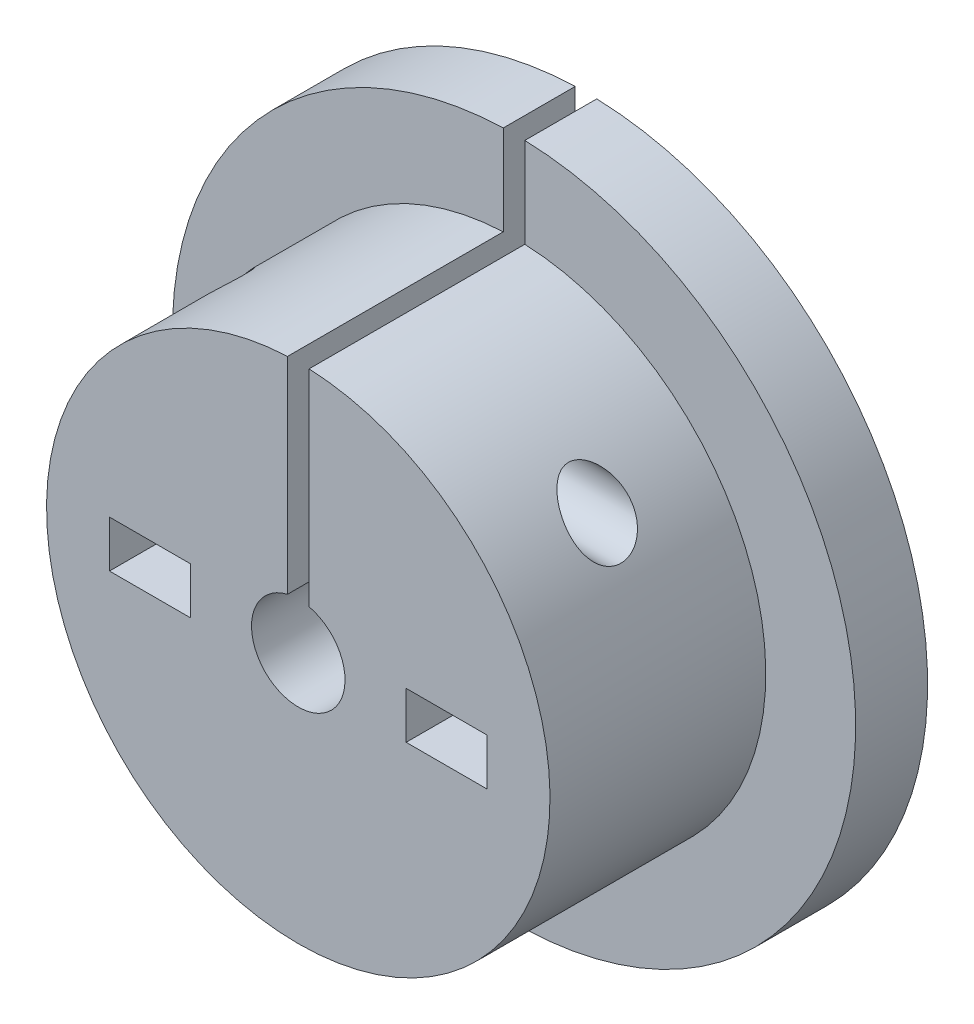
ISO-10303-21;
HEADER;
FILE_DESCRIPTION(('STEP AP214'),'2;1');
FILE_NAME('part.step','',(''),(''),'','','');
FILE_SCHEMA(('AUTOMOTIVE_DESIGN { 1 0 10303 214 1 1 1 1 }'));
ENDSEC;
DATA;
#1=APPLICATION_CONTEXT('core data for automotive mechanical design processes');
#2=APPLICATION_PROTOCOL_DEFINITION('international standard','automotive_design',2000,#1);
#3=PRODUCT_CONTEXT('',#1,'mechanical');
#4=PRODUCT('Part','Part','',(#3));
#5=PRODUCT_RELATED_PRODUCT_CATEGORY('part','',(#4));
#6=PRODUCT_DEFINITION_FORMATION('','',#4);
#7=PRODUCT_DEFINITION_CONTEXT('part definition',#1,'design');
#8=PRODUCT_DEFINITION('design','',#6,#7);
#9=PRODUCT_DEFINITION_SHAPE('','',#8);
#10=(LENGTH_UNIT() NAMED_UNIT(*) SI_UNIT(.MILLI.,.METRE.));
#11=(NAMED_UNIT(*) PLANE_ANGLE_UNIT() SI_UNIT($,.RADIAN.));
#12=(NAMED_UNIT(*) SI_UNIT($,.STERADIAN.) SOLID_ANGLE_UNIT());
#13=UNCERTAINTY_MEASURE_WITH_UNIT(LENGTH_MEASURE(1.E-05),#10,'distance_accuracy_value','');
#14=(GEOMETRIC_REPRESENTATION_CONTEXT(3) GLOBAL_UNCERTAINTY_ASSIGNED_CONTEXT((#13)) GLOBAL_UNIT_ASSIGNED_CONTEXT((#10,
#11,#12)) REPRESENTATION_CONTEXT('',''));
#15=CARTESIAN_POINT('',(0.,0.,0.));
#16=DIRECTION('',(0.,0.,1.));
#17=DIRECTION('',(1.,0.,0.));
#18=AXIS2_PLACEMENT_3D('',#15,#16,#17);
#19=CARTESIAN_POINT('',(0.,0.,4.));
#20=DIRECTION('',(0.,0.,-1.));
#21=DIRECTION('',(-1.,0.,0.));
#22=AXIS2_PLACEMENT_3D('',#19,#20,#21);
#23=CYLINDRICAL_SURFACE('',#22,19.);
#24=CARTESIAN_POINT('',(0.,0.,4.));
#25=DIRECTION('',(0.,0.,1.));
#26=DIRECTION('',(1.,0.,0.));
#27=AXIS2_PLACEMENT_3D('',#24,#25,#26);
#28=CIRCLE('',#27,19.);
#29=CARTESIAN_POINT('',(-0.6,18.9905239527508,4.));
#30=VERTEX_POINT('',#29);
#31=CARTESIAN_POINT('',(0.6,18.9905239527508,4.));
#32=VERTEX_POINT('',#31);
#33=EDGE_CURVE('E267',#30,#32,#28,.T.);
#34=ORIENTED_EDGE('',*,*,#33,.F.);
#35=DIRECTION('',(0.,0.,-1.));
#36=VECTOR('',#35,1.);
#37=CARTESIAN_POINT('',(-0.6,18.9905239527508,4.));
#38=LINE('',#37,#36);
#39=CARTESIAN_POINT('',(-0.6,18.9905239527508,0.));
#40=VERTEX_POINT('',#39);
#41=EDGE_CURVE('E271',#30,#40,#38,.T.);
#42=ORIENTED_EDGE('',*,*,#41,.T.);
#43=CARTESIAN_POINT('',(0.,0.,0.));
#44=DIRECTION('',(0.,0.,1.));
#45=DIRECTION('',(1.,0.,0.));
#46=AXIS2_PLACEMENT_3D('',#43,#44,#45);
#47=CIRCLE('',#46,19.);
#48=CARTESIAN_POINT('',(0.6,18.9905239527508,0.));
#49=VERTEX_POINT('',#48);
#50=EDGE_CURVE('E277',#40,#49,#47,.T.);
#51=ORIENTED_EDGE('',*,*,#50,.T.);
#52=DIRECTION('',(0.,0.,-1.));
#53=VECTOR('',#52,1.);
#54=CARTESIAN_POINT('',(0.6,18.9905239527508,4.));
#55=LINE('',#54,#53);
#56=EDGE_CURVE('E272',#49,#32,#55,.F.);
#57=ORIENTED_EDGE('',*,*,#56,.T.);
#58=EDGE_LOOP('',(#34,#42,#51,#57));
#59=FACE_BOUND('',#58,.T.);
#60=ADVANCED_FACE('F39',(#59),#23,.T.);
#61=CARTESIAN_POINT('',(0.,0.,4.));
#62=DIRECTION('',(0.,0.,1.));
#63=DIRECTION('',(1.,0.,0.));
#64=AXIS2_PLACEMENT_3D('',#61,#62,#63);
#65=PLANE('',#64);
#66=DIRECTION('',(0.,-1.,0.));
#67=VECTOR('',#66,1.);
#68=CARTESIAN_POINT('',(-0.6,0.,4.));
#69=LINE('',#68,#67);
#70=CARTESIAN_POINT('',(-0.6,13.9871369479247,4.));
#71=VERTEX_POINT('',#70);
#72=EDGE_CURVE('E166',#30,#71,#69,.T.);
#73=ORIENTED_EDGE('',*,*,#72,.F.);
#74=ORIENTED_EDGE('',*,*,#33,.T.);
#75=DIRECTION('',(0.,1.,0.));
#76=VECTOR('',#75,1.);
#77=CARTESIAN_POINT('',(0.6,0.,4.));
#78=LINE('',#77,#76);
#79=CARTESIAN_POINT('',(0.6,13.9871369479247,4.));
#80=VERTEX_POINT('',#79);
#81=EDGE_CURVE('E310',#80,#32,#78,.T.);
#82=ORIENTED_EDGE('',*,*,#81,.F.);
#83=CARTESIAN_POINT('',(0.,0.,4.));
#84=DIRECTION('',(0.,0.,1.));
#85=DIRECTION('',(1.,0.,0.));
#86=AXIS2_PLACEMENT_3D('',#83,#84,#85);
#87=CIRCLE('',#86,14.);
#88=EDGE_CURVE('E276',#80,#71,#87,.F.);
#89=ORIENTED_EDGE('',*,*,#88,.T.);
#90=EDGE_LOOP('',(#73,#74,#82,#89));
#91=FACE_BOUND('',#90,.T.);
#92=ADVANCED_FACE('F196',(#91),#65,.T.);
#93=CARTESIAN_POINT('',(0.,0.,0.));
#94=DIRECTION('',(0.,0.,1.));
#95=DIRECTION('',(1.,0.,0.));
#96=AXIS2_PLACEMENT_3D('',#93,#94,#95);
#97=PLANE('',#96);
#98=DIRECTION('',(-1.,0.,0.));
#99=VECTOR('',#98,1.);
#100=CARTESIAN_POINT('',(0.,1.3,0.));
#101=LINE('',#100,#99);
#102=CARTESIAN_POINT('',(-6.,1.3,0.));
#103=VERTEX_POINT('',#102);
#104=CARTESIAN_POINT('',(-10.5,1.3,0.));
#105=VERTEX_POINT('',#104);
#106=EDGE_CURVE('E298',#103,#105,#101,.T.);
#107=ORIENTED_EDGE('',*,*,#106,.T.);
#108=DIRECTION('',(0.,-1.,0.));
#109=VECTOR('',#108,1.);
#110=CARTESIAN_POINT('',(-10.5,0.,0.));
#111=LINE('',#110,#109);
#112=CARTESIAN_POINT('',(-10.5,-1.3,0.));
#113=VERTEX_POINT('',#112);
#114=EDGE_CURVE('E152',#105,#113,#111,.T.);
#115=ORIENTED_EDGE('',*,*,#114,.T.);
#116=DIRECTION('',(1.,0.,0.));
#117=VECTOR('',#116,1.);
#118=CARTESIAN_POINT('',(0.,-1.3,0.));
#119=LINE('',#118,#117);
#120=CARTESIAN_POINT('',(-6.,-1.3,0.));
#121=VERTEX_POINT('',#120);
#122=EDGE_CURVE('E329',#113,#121,#119,.T.);
#123=ORIENTED_EDGE('',*,*,#122,.T.);
#124=DIRECTION('',(0.,1.,0.));
#125=VECTOR('',#124,1.);
#126=CARTESIAN_POINT('',(-6.,0.,0.));
#127=LINE('',#126,#125);
#128=EDGE_CURVE('E327',#121,#103,#127,.T.);
#129=ORIENTED_EDGE('',*,*,#128,.T.);
#130=EDGE_LOOP('',(#107,#115,#123,#129));
#131=FACE_BOUND('',#130,.T.);
#132=DIRECTION('',(-1.,0.,0.));
#133=VECTOR('',#132,1.);
#134=CARTESIAN_POINT('',(0.,1.3,0.));
#135=LINE('',#134,#133);
#136=CARTESIAN_POINT('',(10.5,1.3,0.));
#137=VERTEX_POINT('',#136);
#138=CARTESIAN_POINT('',(6.,1.3,0.));
#139=VERTEX_POINT('',#138);
#140=EDGE_CURVE('E303',#137,#139,#135,.T.);
#141=ORIENTED_EDGE('',*,*,#140,.T.);
#142=DIRECTION('',(0.,-1.,0.));
#143=VECTOR('',#142,1.);
#144=CARTESIAN_POINT('',(6.,0.,0.));
#145=LINE('',#144,#143);
#146=CARTESIAN_POINT('',(6.,-1.3,0.));
#147=VERTEX_POINT('',#146);
#148=EDGE_CURVE('E334',#139,#147,#145,.T.);
#149=ORIENTED_EDGE('',*,*,#148,.T.);
#150=DIRECTION('',(1.,0.,0.));
#151=VECTOR('',#150,1.);
#152=CARTESIAN_POINT('',(0.,-1.3,0.));
#153=LINE('',#152,#151);
#154=CARTESIAN_POINT('',(10.5,-1.3,0.));
#155=VERTEX_POINT('',#154);
#156=EDGE_CURVE('E94',#147,#155,#153,.T.);
#157=ORIENTED_EDGE('',*,*,#156,.T.);
#158=DIRECTION('',(0.,1.,0.));
#159=VECTOR('',#158,1.);
#160=CARTESIAN_POINT('',(10.5,0.,0.));
#161=LINE('',#160,#159);
#162=EDGE_CURVE('E336',#155,#137,#161,.T.);
#163=ORIENTED_EDGE('',*,*,#162,.T.);
#164=EDGE_LOOP('',(#141,#149,#157,#163));
#165=FACE_BOUND('',#164,.T.);
#166=ORIENTED_EDGE('',*,*,#50,.F.);
#167=DIRECTION('',(0.,-1.,0.));
#168=VECTOR('',#167,1.);
#169=CARTESIAN_POINT('',(-0.6,0.,0.));
#170=LINE('',#169,#168);
#171=CARTESIAN_POINT('',(-0.600000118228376,2.52993670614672,-8.99999999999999E-06));
#172=VERTEX_POINT('',#171);
#173=EDGE_CURVE('E308',#40,#172,#170,.T.);
#174=ORIENTED_EDGE('',*,*,#173,.T.);
#175=CARTESIAN_POINT('',(-0.60005169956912,2.53026829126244,0.));
#176=CARTESIAN_POINT('',(-0.643668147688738,2.51989298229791,0.));
#177=CARTESIAN_POINT('',(-0.68701076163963,2.50836147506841,0.));
#178=CARTESIAN_POINT('',(-0.773252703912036,2.48299902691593,0.));
#179=CARTESIAN_POINT('',(-0.816148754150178,2.46915693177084,0.));
#180=CARTESIAN_POINT('',(-0.881555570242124,2.4461799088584,0.));
#181=CARTESIAN_POINT('',(-0.904341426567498,2.43781932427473,0.));
#182=CARTESIAN_POINT('',(-0.949786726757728,2.42043838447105,0.));
#183=CARTESIAN_POINT('',(-0.972445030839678,2.41141504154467,0.));
#184=CARTESIAN_POINT('',(-1.01447809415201,2.39401325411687,0.));
#185=CARTESIAN_POINT('',(-1.03388457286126,2.38571131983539,0.));
#186=CARTESIAN_POINT('',(-1.07241652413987,2.36868196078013,0.));
#187=CARTESIAN_POINT('',(-1.09154281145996,2.35995637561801,0.));
#188=CARTESIAN_POINT('',(-1.15131120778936,2.33181861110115,0.));
#189=CARTESIAN_POINT('',(-1.19157119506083,2.31158584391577,0.));
#190=CARTESIAN_POINT('',(-1.27078515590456,2.26914364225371,0.));
#191=CARTESIAN_POINT('',(-1.30974446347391,2.24694414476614,0.));
#192=CARTESIAN_POINT('',(-1.38636211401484,2.20057343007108,0.));
#193=CARTESIAN_POINT('',(-1.42402298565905,2.17640639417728,0.));
#194=CARTESIAN_POINT('',(-1.49804614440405,2.12610649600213,0.));
#195=CARTESIAN_POINT('',(-1.53440751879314,2.09997229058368,0.));
#196=CARTESIAN_POINT('',(-1.60583473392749,2.04574417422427,0.));
#197=CARTESIAN_POINT('',(-1.64089567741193,2.01764381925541,0.));
#198=CARTESIAN_POINT('',(-1.70972877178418,1.959485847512,0.));
#199=CARTESIAN_POINT('',(-1.74349166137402,1.92941724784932,0.));
#200=CARTESIAN_POINT('',(-1.7869433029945,1.88868881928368,0.));
#201=CARTESIAN_POINT('',(-1.7973439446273,1.87878053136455,0.));
#202=CARTESIAN_POINT('',(-1.818016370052,1.85876831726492,0.));
#203=CARTESIAN_POINT('',(-1.82828767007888,1.84866389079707,0.));
#204=CARTESIAN_POINT('',(-1.86043961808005,1.81652362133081,0.));
#205=CARTESIAN_POINT('',(-1.88202377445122,1.79418948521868,0.));
#206=CARTESIAN_POINT('',(-1.92427413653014,1.74890081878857,0.));
#207=CARTESIAN_POINT('',(-1.94494474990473,1.72595039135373,0.));
#208=CARTESIAN_POINT('',(-1.99467203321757,1.66872443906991,0.));
#209=CARTESIAN_POINT('',(-2.02326699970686,1.63404549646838,0.));
#210=CARTESIAN_POINT('',(-2.07849633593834,1.56336269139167,0.));
#211=CARTESIAN_POINT('',(-2.10513740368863,1.52736405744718,0.));
#212=CARTESIAN_POINT('',(-2.15646502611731,1.4540449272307,0.));
#213=CARTESIAN_POINT('',(-2.18115324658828,1.4167255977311,0.));
#214=CARTESIAN_POINT('',(-2.22857992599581,1.34076997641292,0.));
#215=CARTESIAN_POINT('',(-2.25131458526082,1.3021313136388,0.));
#216=CARTESIAN_POINT('',(-2.29695458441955,1.21971993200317,0.));
#217=CARTESIAN_POINT('',(-2.31964062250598,1.1758256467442,0.));
#218=CARTESIAN_POINT('',(-2.36268488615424,1.08646171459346,0.));
#219=CARTESIAN_POINT('',(-2.38302221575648,1.04098201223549,0.));
#220=CARTESIAN_POINT('',(-2.41777719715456,0.957114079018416,0.));
#221=CARTESIAN_POINT('',(-2.43260550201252,0.918895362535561,0.));
#222=CARTESIAN_POINT('',(-2.46036499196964,0.842066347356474,0.));
#223=CARTESIAN_POINT('',(-2.47330834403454,0.803460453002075,0.));
#224=CARTESIAN_POINT('',(-2.49858082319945,0.721726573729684,0.));
#225=CARTESIAN_POINT('',(-2.51071382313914,0.678537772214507,0.));
#226=CARTESIAN_POINT('',(-2.53266441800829,0.591686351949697,0.));
#227=CARTESIAN_POINT('',(-2.54248751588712,0.548025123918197,0.));
#228=CARTESIAN_POINT('',(-2.55982476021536,0.46023075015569,0.));
#229=CARTESIAN_POINT('',(-2.56733809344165,0.416097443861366,0.));
#230=CARTESIAN_POINT('',(-2.58006227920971,0.327359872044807,0.));
#231=CARTESIAN_POINT('',(-2.58526589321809,0.282754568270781,0.));
#232=CARTESIAN_POINT('',(-2.59287513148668,0.198619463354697,0.));
#233=CARTESIAN_POINT('',(-2.59553871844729,0.1591127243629,0.));
#234=CARTESIAN_POINT('',(-2.59910441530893,0.079738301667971,0.));
#235=CARTESIAN_POINT('',(-2.59999381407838,0.0398700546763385,0.));
#236=CARTESIAN_POINT('',(-2.60000789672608,-0.0508966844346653,0.));
#237=CARTESIAN_POINT('',(-2.59857649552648,-0.101796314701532,0.));
#238=CARTESIAN_POINT('',(-2.59276866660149,-0.203031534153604,0.));
#239=CARTESIAN_POINT('',(-2.58841520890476,-0.253368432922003,0.));
#240=CARTESIAN_POINT('',(-2.57741133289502,-0.348015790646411,0.));
#241=CARTESIAN_POINT('',(-2.57107685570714,-0.392363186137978,0.));
#242=CARTESIAN_POINT('',(-2.55609026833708,-0.480610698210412,0.));
#243=CARTESIAN_POINT('',(-2.54744094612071,-0.524511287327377,0.));
#244=CARTESIAN_POINT('',(-2.52783149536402,-0.611864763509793,0.));
#245=CARTESIAN_POINT('',(-2.51686776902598,-0.655316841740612,0.));
#246=CARTESIAN_POINT('',(-2.49263513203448,-0.741776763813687,0.));
#247=CARTESIAN_POINT('',(-2.47935648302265,-0.784781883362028,0.));
#248=CARTESIAN_POINT('',(-2.45547308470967,-0.855604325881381,0.));
#249=CARTESIAN_POINT('',(-2.44548612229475,-0.883631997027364,0.));
#250=CARTESIAN_POINT('',(-2.42451803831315,-0.939497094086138,0.));
#251=CARTESIAN_POINT('',(-2.41353155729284,-0.967332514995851,0.));
#252=CARTESIAN_POINT('',(-2.39612989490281,-1.00936556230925,0.));
#253=CARTESIAN_POINT('',(-2.39004884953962,-1.0237024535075,0.));
#254=CARTESIAN_POINT('',(-2.37765560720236,-1.052223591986,0.));
#255=CARTESIAN_POINT('',(-2.3713441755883,-1.06640817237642,0.));
#256=CARTESIAN_POINT('',(-2.34620785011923,-1.12158685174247,0.));
#257=CARTESIAN_POINT('',(-2.32645471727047,-1.16216374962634,0.));
#258=CARTESIAN_POINT('',(-2.2849705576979,-1.24201062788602,0.));
#259=CARTESIAN_POINT('',(-2.26325088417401,-1.2812865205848,0.));
#260=CARTESIAN_POINT('',(-2.21783831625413,-1.35853685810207,0.));
#261=CARTESIAN_POINT('',(-2.19415099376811,-1.39651457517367,0.));
#262=CARTESIAN_POINT('',(-2.14480916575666,-1.47117058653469,0.));
#263=CARTESIAN_POINT('',(-2.11915463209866,-1.50784886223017,0.));
#264=CARTESIAN_POINT('',(-2.06588445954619,-1.57990906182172,0.));
#265=CARTESIAN_POINT('',(-2.03826357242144,-1.6152871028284,0.));
#266=CARTESIAN_POINT('',(-1.98106371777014,-1.68475299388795,0.));
#267=CARTESIAN_POINT('',(-1.95147481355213,-1.71883267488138,0.));
#268=CARTESIAN_POINT('',(-1.90762873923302,-1.76679754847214,0.));
#269=CARTESIAN_POINT('',(-1.89405563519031,-1.7813135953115,0.));
#270=CARTESIAN_POINT('',(-1.86653393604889,-1.810098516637,0.));
#271=CARTESIAN_POINT('',(-1.85258404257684,-1.82436615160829,0.));
#272=CARTESIAN_POINT('',(-1.82042783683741,-1.85653391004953,0.));
#273=CARTESIAN_POINT('',(-1.80212178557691,-1.87433452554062,0.));
#274=CARTESIAN_POINT('',(-1.76509115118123,-1.90931657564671,0.));
#275=CARTESIAN_POINT('',(-1.74636894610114,-1.92650053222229,0.));
#276=CARTESIAN_POINT('',(-1.69381714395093,-1.97334340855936,0.));
#277=CARTESIAN_POINT('',(-1.65946008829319,-2.0024147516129,0.));
#278=CARTESIAN_POINT('',(-1.58942009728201,-2.05859552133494,0.));
#279=CARTESIAN_POINT('',(-1.55374344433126,-2.085712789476,0.));
#280=CARTESIAN_POINT('',(-1.48106768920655,-2.13799151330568,0.));
#281=CARTESIAN_POINT('',(-1.44407070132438,-2.16315590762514,0.));
#282=CARTESIAN_POINT('',(-1.36875678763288,-2.21153438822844,0.));
#283=CARTESIAN_POINT('',(-1.33043829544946,-2.23474603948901,0.));
#284=CARTESIAN_POINT('',(-1.26777402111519,-2.27050164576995,0.));
#285=CARTESIAN_POINT('',(-1.24378971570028,-2.28368363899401,0.));
#286=CARTESIAN_POINT('',(-1.19533263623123,-2.30932643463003,0.));
#287=CARTESIAN_POINT('',(-1.1708584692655,-2.3217846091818,0.));
#288=CARTESIAN_POINT('',(-1.12142248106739,-2.34597980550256,0.));
#289=CARTESIAN_POINT('',(-1.09645898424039,-2.35771340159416,0.));
#290=CARTESIAN_POINT('',(-1.04604525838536,-2.38046115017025,0.));
#291=CARTESIAN_POINT('',(-1.02059313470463,-2.39147109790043,0.));
#292=CARTESIAN_POINT('',(-0.962208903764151,-2.41566627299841,0.));
#293=CARTESIAN_POINT('',(-0.929172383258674,-2.42860062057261,0.));
#294=CARTESIAN_POINT('',(-0.862808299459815,-2.45305077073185,0.));
#295=CARTESIAN_POINT('',(-0.829483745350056,-2.46457475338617,0.));
#296=CARTESIAN_POINT('',(-0.753223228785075,-2.48921934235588,0.));
#297=CARTESIAN_POINT('',(-0.710149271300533,-2.50191571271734,0.));
#298=CARTESIAN_POINT('',(-0.623527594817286,-2.52499136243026,0.));
#299=CARTESIAN_POINT('',(-0.579981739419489,-2.53537764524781,0.));
#300=CARTESIAN_POINT('',(-0.492417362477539,-2.55383979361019,0.));
#301=CARTESIAN_POINT('',(-0.448398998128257,-2.56191640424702,0.));
#302=CARTESIAN_POINT('',(-0.359891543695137,-2.575765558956,0.));
#303=CARTESIAN_POINT('',(-0.315401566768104,-2.58153242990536,0.));
#304=CARTESIAN_POINT('',(-0.225995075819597,-2.59076348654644,0.));
#305=CARTESIAN_POINT('',(-0.181077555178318,-2.59421790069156,0.));
#306=CARTESIAN_POINT('',(-0.0907740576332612,-2.59884162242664,0.));
#307=CARTESIAN_POINT('',(-0.0453871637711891,-2.59999285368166,0.));
#308=CARTESIAN_POINT('',(0.0453936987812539,-2.60000714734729,0.));
#309=CARTESIAN_POINT('',(0.0907876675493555,-2.59886988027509,0.));
#310=CARTESIAN_POINT('',(0.18112798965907,-2.5942575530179,0.));
#311=CARTESIAN_POINT('',(0.226075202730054,-2.59079949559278,0.));
#312=CARTESIAN_POINT('',(0.31547787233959,-2.58155840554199,0.));
#313=CARTESIAN_POINT('',(0.35993467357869,-2.57578840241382,0.));
#314=CARTESIAN_POINT('',(0.448400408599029,-2.56192917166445,0.));
#315=CARTESIAN_POINT('',(0.492410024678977,-2.55384430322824,0.));
#316=CARTESIAN_POINT('',(0.579981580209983,-2.53536211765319,0.));
#317=CARTESIAN_POINT('',(0.623543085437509,-2.52496274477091,0.));
#318=CARTESIAN_POINT('',(0.710220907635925,-2.50185752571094,0.));
#319=CARTESIAN_POINT('',(0.753335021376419,-2.48914340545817,0.));
#320=CARTESIAN_POINT('',(0.829601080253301,-2.46449175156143,0.));
#321=CARTESIAN_POINT('',(0.862891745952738,-2.45298052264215,0.));
#322=CARTESIAN_POINT('',(0.929205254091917,-2.42856220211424,0.));
#323=CARTESIAN_POINT('',(0.962224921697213,-2.41564647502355,0.));
#324=CARTESIAN_POINT('',(1.02058911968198,-2.39148305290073,0.));
#325=CARTESIAN_POINT('',(1.04603762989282,-2.38048551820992,0.));
#326=CARTESIAN_POINT('',(1.09644978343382,-2.35775389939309,0.));
#327=CARTESIAN_POINT('',(1.12141522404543,-2.34602380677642,0.));
#328=CARTESIAN_POINT('',(1.17086154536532,-2.3218287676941,0.));
#329=CARTESIAN_POINT('',(1.19534398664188,-2.30936701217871,0.));
#330=CARTESIAN_POINT('',(1.24382387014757,-2.28370973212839,0.));
#331=CARTESIAN_POINT('',(1.26782257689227,-2.27051659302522,0.));
#332=CARTESIAN_POINT('',(1.33047851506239,-2.23475328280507,0.));
#333=CARTESIAN_POINT('',(1.36877417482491,-2.21154516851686,0.));
#334=CARTESIAN_POINT('',(1.44406384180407,-2.16316104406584,0.));
#335=CARTESIAN_POINT('',(1.48105869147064,-2.13798634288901,0.));
#336=CARTESIAN_POINT('',(1.55375163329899,-2.08567423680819,0.));
#337=CARTESIAN_POINT('',(1.58944683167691,-2.05853281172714,0.));
#338=CARTESIAN_POINT('',(1.65954556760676,-2.00229105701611,0.));
#339=CARTESIAN_POINT('',(1.69394201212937,-1.97318187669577,0.));
#340=CARTESIAN_POINT('',(1.74650010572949,-1.92633341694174,0.));
#341=CARTESIAN_POINT('',(1.76518979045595,-1.90918232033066,0.));
#342=CARTESIAN_POINT('',(1.80216557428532,-1.87426672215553,0.));
#343=CARTESIAN_POINT('',(1.82044918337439,-1.85649957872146,0.));
#344=CARTESIAN_POINT('',(1.85262399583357,-1.82433636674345,0.));
#345=CARTESIAN_POINT('',(1.86661325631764,-1.81003821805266,0.));
#346=CARTESIAN_POINT('',(1.89421252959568,-1.78118554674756,0.));
#347=CARTESIAN_POINT('',(1.90782378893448,-1.76663221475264,0.));
#348=CARTESIAN_POINT('',(1.95166676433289,-1.71867446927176,0.));
#349=CARTESIAN_POINT('',(1.98121447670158,-1.68463924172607,0.));
#350=CARTESIAN_POINT('',(2.03834660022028,-1.61524221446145,0.));
#351=CARTESIAN_POINT('',(2.06593995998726,-1.57988776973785,0.));
#352=CARTESIAN_POINT('',(2.11916999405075,-1.50785486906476,0.));
#353=CARTESIAN_POINT('',(2.14481085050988,-1.47117950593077,0.));
#354=CARTESIAN_POINT('',(2.19414027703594,-1.3965093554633,0.));
#355=CARTESIAN_POINT('',(2.21782775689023,-1.35851384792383,0.));
#356=CARTESIAN_POINT('',(2.26325559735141,-1.2812078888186,0.));
#357=CARTESIAN_POINT('',(2.2849892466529,-1.24189349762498,0.));
#358=CARTESIAN_POINT('',(2.32651650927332,-1.16194959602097,0.));
#359=CARTESIAN_POINT('',(2.34629764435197,-1.12131358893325,0.));
#360=CARTESIAN_POINT('',(2.37144033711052,-1.06613155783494,0.));
#361=CARTESIAN_POINT('',(2.3777295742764,-1.05200254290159,0.));
#362=CARTESIAN_POINT('',(2.39008312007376,-1.02359205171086,0.));
#363=CARTESIAN_POINT('',(2.39614663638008,-1.009310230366,0.));
#364=CARTESIAN_POINT('',(2.41355937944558,-0.967294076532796,0.));
#365=CARTESIAN_POINT('',(2.42457179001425,-0.939419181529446,0.));
#366=CARTESIAN_POINT('',(2.44558614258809,-0.883465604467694,0.));
#367=CARTESIAN_POINT('',(2.4555932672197,-0.855388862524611,0.));
#368=CARTESIAN_POINT('',(2.47948138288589,-0.784551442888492,0.));
#369=CARTESIAN_POINT('',(2.49274600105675,-0.741580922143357,0.));
#370=CARTESIAN_POINT('',(2.51695378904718,-0.655171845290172,0.));
#371=CARTESIAN_POINT('',(2.52790576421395,-0.611735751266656,0.));
#372=CARTESIAN_POINT('',(2.54749508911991,-0.524395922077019,0.));
#373=CARTESIAN_POINT('',(2.55613505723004,-0.480492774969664,0.));
#374=CARTESIAN_POINT('',(2.57110651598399,-0.392221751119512,0.));
#375=CARTESIAN_POINT('',(2.57743421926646,-0.347853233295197,0.));
#376=CARTESIAN_POINT('',(2.58841694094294,-0.253225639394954,0.));
#377=CARTESIAN_POINT('',(2.5927598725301,-0.202930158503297,0.));
#378=CARTESIAN_POINT('',(2.59856379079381,-0.101756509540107,0.));
#379=CARTESIAN_POINT('',(2.60000062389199,-0.0508769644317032,0.));
#380=CARTESIAN_POINT('',(2.59999951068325,0.0399026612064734,0.));
#381=CARTESIAN_POINT('',(2.59911480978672,0.079803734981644,0.));
#382=CARTESIAN_POINT('',(2.59554712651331,0.159256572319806,0.));
#383=CARTESIAN_POINT('',(2.59287632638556,0.198808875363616,0.));
#384=CARTESIAN_POINT('',(2.58525116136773,0.282959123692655,0.));
#385=CARTESIAN_POINT('',(2.58004198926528,0.327534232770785,0.));
#386=CARTESIAN_POINT('',(2.56730511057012,0.416230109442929,0.));
#387=CARTESIAN_POINT('',(2.55978364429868,0.460351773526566,0.));
#388=CARTESIAN_POINT('',(2.54242856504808,0.548141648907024,0.));
#389=CARTESIAN_POINT('',(2.53259477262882,0.591809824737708,0.));
#390=CARTESIAN_POINT('',(2.5106220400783,0.6786938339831,0.));
#391=CARTESIAN_POINT('',(2.49847663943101,0.721908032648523,0.));
#392=CARTESIAN_POINT('',(2.4718848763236,0.80788507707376,0.));
#393=CARTESIAN_POINT('',(2.45742610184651,0.850644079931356,0.));
#394=CARTESIAN_POINT('',(2.42623198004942,0.935686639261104,0.));
#395=CARTESIAN_POINT('',(2.40948036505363,0.977964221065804,0.));
#396=CARTESIAN_POINT('',(2.37392968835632,1.06144668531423,0.));
#397=CARTESIAN_POINT('',(2.35513924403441,1.10265523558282,0.));
#398=CARTESIAN_POINT('',(2.31557368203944,1.18376637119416,0.));
#399=CARTESIAN_POINT('',(2.29481277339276,1.22367587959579,0.));
#400=CARTESIAN_POINT('',(2.25131585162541,1.30219192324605,0.));
#401=CARTESIAN_POINT('',(2.2285882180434,1.34080309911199,0.));
#402=CARTESIAN_POINT('',(2.18116281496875,1.41672462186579,0.));
#403=CARTESIAN_POINT('',(2.1564677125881,1.45403663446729,0.));
#404=CARTESIAN_POINT('',(2.10511319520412,1.52736284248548,0.));
#405=CARTESIAN_POINT('',(2.07845101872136,1.5633751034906,0.));
#406=CARTESIAN_POINT('',(2.02316836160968,1.63410626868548,0.));
#407=CARTESIAN_POINT('',(1.99454016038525,1.66881913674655,0.));
#408=CARTESIAN_POINT('',(1.93532773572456,1.73695284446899,0.));
#409=CARTESIAN_POINT('',(1.90473142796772,1.77036317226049,0.));
#410=CARTESIAN_POINT('',(1.84176650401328,1.8357308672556,0.));
#411=CARTESIAN_POINT('',(1.80939121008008,1.86768179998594,0.));
#412=CARTESIAN_POINT('',(1.74329297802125,1.92964313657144,0.));
#413=CARTESIAN_POINT('',(1.70958212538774,1.95966642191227,0.));
#414=CARTESIAN_POINT('',(1.64082985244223,2.0177493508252,0.));
#415=CARTESIAN_POINT('',(1.60579689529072,2.04581900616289,0.));
#416=CARTESIAN_POINT('',(1.5344065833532,2.10000039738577,0.));
#417=CARTESIAN_POINT('',(1.49805332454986,2.12611752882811,0.));
#418=CARTESIAN_POINT('',(1.42402633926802,2.17639815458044,0.));
#419=CARTESIAN_POINT('',(1.38635277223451,2.2005618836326,0.));
#420=CARTESIAN_POINT('',(1.30968931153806,2.24694140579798,0.));
#421=CARTESIAN_POINT('',(1.2706962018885,2.26915188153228,0.));
#422=CARTESIAN_POINT('',(1.19139632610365,2.31162936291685,0.));
#423=CARTESIAN_POINT('',(1.15108362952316,2.3318852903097,0.));
#424=CARTESIAN_POINT('',(1.06915795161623,2.3704596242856,0.));
#425=CARTESIAN_POINT('',(1.02753727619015,2.38876167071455,0.));
#426=CARTESIAN_POINT('',(0.943546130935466,2.42319089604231,0.));
#427=CARTESIAN_POINT('',(0.90117817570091,2.4393242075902,0.));
#428=CARTESIAN_POINT('',(0.815961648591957,2.4692630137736,0.));
#429=CARTESIAN_POINT('',(0.773118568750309,2.48308411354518,0.));
#430=CARTESIAN_POINT('',(0.686958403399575,2.50841071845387,0.));
#431=CARTESIAN_POINT('',(0.643644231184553,2.51992614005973,0.));
#432=CARTESIAN_POINT('',(0.600053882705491,2.53028751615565,0.));
#433=B_SPLINE_CURVE_WITH_KNOTS('',3,(#175,#176,#177,#178,#179,#180,#181,#182,#183,#184,#185,
#186,#187,#188,#189,#190,#191,#192,#193,#194,#195,#196,#197,#198,#199,#200,#201,#202,#203,#204,
#205,#206,#207,#208,#209,#210,#211,#212,#213,#214,#215,#216,#217,#218,#219,#220,#221,#222,#223,
#224,#225,#226,#227,#228,#229,#230,#231,#232,#233,#234,#235,#236,#237,#238,#239,#240,#241,#242,
#243,#244,#245,#246,#247,#248,#249,#250,#251,#252,#253,#254,#255,#256,#257,#258,#259,#260,#261,
#262,#263,#264,#265,#266,#267,#268,#269,#270,#271,#272,#273,#274,#275,#276,#277,#278,#279,#280,
#281,#282,#283,#284,#285,#286,#287,#288,#289,#290,#291,#292,#293,#294,#295,#296,#297,#298,#299,
#300,#301,#302,#303,#304,#305,#306,#307,#308,#309,#310,#311,#312,#313,#314,#315,#316,#317,#318,
#319,#320,#321,#322,#323,#324,#325,#326,#327,#328,#329,#330,#331,#332,#333,#334,#335,#336,#337,
#338,#339,#340,#341,#342,#343,#344,#345,#346,#347,#348,#349,#350,#351,#352,#353,#354,#355,#356,
#357,#358,#359,#360,#361,#362,#363,#364,#365,#366,#367,#368,#369,#370,#371,#372,#373,#374,#375,
#376,#377,#378,#379,#380,#381,#382,#383,#384,#385,#386,#387,#388,#389,#390,#391,#392,#393,#394,
#395,#396,#397,#398,#399,#400,#401,#402,#403,#404,#405,#406,#407,#408,#409,#410,#411,#412,#413,
#414,#415,#416,#417,#418,#419,#420,#421,#422,#423,#424,#425,#426,#427,#428,#429,#430,#431,#432),
.UNSPECIFIED.,.F.,.F.,(4,2,2,2,2,2,2,2,2,2,2,2,2,2,2,2,2,2,2,2,2,2,2,2,2,2,2,2,2,2,2,2,2,2,2,2,
2,2,2,2,2,2,2,2,2,2,2,2,2,2,2,2,2,2,2,2,2,2,2,2,2,2,2,2,2,2,2,2,2,2,2,2,2,2,2,2,2,2,2,2,2,2,2,2,
2,2,2,2,2,2,2,2,2,2,2,2,2,2,2,2,2,2,2,2,2,2,2,2,2,2,2,2,2,2,2,2,2,2,2,2,2,2,2,2,2,2,2,2,4),(0.,
0.134488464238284,0.269646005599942,0.342452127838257,0.415609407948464,0.478926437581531,
0.54198957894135,0.677097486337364,0.811557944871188,0.945739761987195,1.08001404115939,
1.21475112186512,1.35031755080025,1.39341076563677,1.43663406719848,1.52979139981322,
1.62243474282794,1.75721325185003,1.89150575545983,2.02568244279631,2.16011445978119,
2.30826395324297,2.45764375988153,2.58058547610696,2.70269465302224,2.83721438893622,
2.9714103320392,3.10565346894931,3.24031439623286,3.35906344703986,3.47866026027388,
3.63133327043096,3.78281997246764,3.917151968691,4.05132289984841,4.18570395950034,
4.32066460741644,4.4099110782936,4.49966800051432,4.5463855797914,4.59296001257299,
4.72828120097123,4.86286569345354,4.99708128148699,5.13129878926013,5.2658890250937,
5.40121973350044,5.46083554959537,5.52069286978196,5.59728302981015,5.67351236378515,
5.80846514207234,5.94284213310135,6.07701283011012,6.21134842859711,6.29344047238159,
6.37581399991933,6.45855110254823,6.54173279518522,6.64813804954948,6.75389353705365,
6.88854825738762,7.02278900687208,7.15698640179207,7.29151141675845,7.42660135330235,
7.56274743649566,7.69891312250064,7.8340919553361,7.96851943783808,8.10269542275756,
8.2369910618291,8.37177651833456,8.47742382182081,8.58376196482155,8.66691881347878,
8.74965655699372,8.83205698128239,8.91420287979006,9.04847430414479,9.182657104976,
9.31712237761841,9.4522388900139,9.52832986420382,9.60480191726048,9.66480716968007,
9.72458277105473,9.85973152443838,9.99421498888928,10.128401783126,10.262662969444,
10.3973689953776,10.5328866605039,10.579281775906,10.6258267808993,10.715722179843,
10.8051273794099,10.9399762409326,11.074302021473,11.208475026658,11.3428668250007,
11.4942277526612,11.6468416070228,11.7665362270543,11.8854226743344,12.0199955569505,
12.1542084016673,12.2884316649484,12.4230357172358,12.5583878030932,12.6947554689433,
12.830567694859,12.9654658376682,13.0998151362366,13.2339853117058,13.3683475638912,
13.5032715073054,13.639122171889,13.7755231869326,13.9108895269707,14.0455013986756,
14.179726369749,14.3139351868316,14.4484987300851,14.5837849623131,14.7201273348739,
14.8560756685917,14.9910658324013,15.125462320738),.UNSPECIFIED.);
#434=CARTESIAN_POINT('',(0.600000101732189,2.52994164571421,-8.99999999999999E-06));
#435=VERTEX_POINT('',#434);
#436=EDGE_CURVE('E162',#172,#435,#433,.T.);
#437=ORIENTED_EDGE('',*,*,#436,.T.);
#438=DIRECTION('',(0.,1.,0.));
#439=VECTOR('',#438,1.);
#440=CARTESIAN_POINT('',(0.6,0.,0.));
#441=LINE('',#440,#439);
#442=EDGE_CURVE('E307',#435,#49,#441,.T.);
#443=ORIENTED_EDGE('',*,*,#442,.T.);
#444=EDGE_LOOP('',(#166,#174,#437,#443));
#445=FACE_BOUND('',#444,.T.);
#446=ADVANCED_FACE('F198',(#131,#165,#445),#97,.F.);
#447=CARTESIAN_POINT('',(0.,0.,16.));
#448=DIRECTION('',(0.,0.,-1.));
#449=DIRECTION('',(-1.,0.,0.));
#450=AXIS2_PLACEMENT_3D('',#447,#448,#449);
#451=CYLINDRICAL_SURFACE('',#450,14.);
#452=CARTESIAN_POINT('',(-10.7238052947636,9.,8.3));
#453=CARTESIAN_POINT('',(-10.6315978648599,9.10986405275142,8.29999997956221));
#454=CARTESIAN_POINT('',(-10.5376594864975,9.21834091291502,8.31063631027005));
#455=CARTESIAN_POINT('',(-10.3482239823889,9.43051622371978,8.35185194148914));
#456=CARTESIAN_POINT('',(-10.2527226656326,9.53419731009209,8.38249843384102));
#457=CARTESIAN_POINT('',(-10.0469131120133,9.75116642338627,8.46977943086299));
#458=CARTESIAN_POINT('',(-9.93673641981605,9.86325427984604,8.52984325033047));
#459=CARTESIAN_POINT('',(-9.77601608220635,10.0217380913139,8.63979091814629));
#460=CARTESIAN_POINT('',(-9.72322681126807,10.0729334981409,8.67972243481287));
#461=CARTESIAN_POINT('',(-9.61993029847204,10.1716280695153,8.76646798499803));
#462=CARTESIAN_POINT('',(-9.56942133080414,10.2191300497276,8.81327669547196));
#463=CARTESIAN_POINT('',(-9.4650273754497,10.3159580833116,8.9210190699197));
#464=CARTESIAN_POINT('',(-9.41162575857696,10.3646447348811,8.98300903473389));
#465=CARTESIAN_POINT('',(-9.31138533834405,10.4547898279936,9.11678339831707));
#466=CARTESIAN_POINT('',(-9.26453628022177,10.4962595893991,9.18855213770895));
#467=CARTESIAN_POINT('',(-9.18961035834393,10.5618649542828,9.32544242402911));
#468=CARTESIAN_POINT('',(-9.15966407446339,10.5878100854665,9.38865828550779));
#469=CARTESIAN_POINT('',(-9.1077377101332,10.6325111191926,9.52068531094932));
#470=CARTESIAN_POINT('',(-9.08574686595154,10.6512767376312,9.58948875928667));
#471=CARTESIAN_POINT('',(-9.05428835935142,10.6780254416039,9.72068246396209));
#472=CARTESIAN_POINT('',(-9.04344011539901,10.6872009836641,9.78249403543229));
#473=CARTESIAN_POINT('',(-9.02989499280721,10.6986485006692,9.90762973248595));
#474=CARTESIAN_POINT('',(-9.02719311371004,10.7009247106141,9.97095290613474));
#475=CARTESIAN_POINT('',(-9.03019589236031,10.6983907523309,10.0972701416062));
#476=CARTESIAN_POINT('',(-9.03590313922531,10.6935784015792,10.1602640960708));
#477=CARTESIAN_POINT('',(-9.05518746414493,10.6772531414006,10.2841396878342));
#478=CARTESIAN_POINT('',(-9.06877027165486,10.6657353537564,10.3450197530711));
#479=CARTESIAN_POINT('',(-9.10703492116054,10.6330940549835,10.4783648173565));
#480=CARTESIAN_POINT('',(-9.13365784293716,10.6102753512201,10.5498527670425));
#481=CARTESIAN_POINT('',(-9.19507828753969,10.5570917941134,10.6861834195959));
#482=CARTESIAN_POINT('',(-9.22989064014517,10.526713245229,10.7510137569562));
#483=CARTESIAN_POINT('',(-9.32128503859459,10.4459904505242,10.8994075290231));
#484=CARTESIAN_POINT('',(-9.38087910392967,10.3926122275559,10.9794490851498));
#485=CARTESIAN_POINT('',(-9.50743394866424,10.2769700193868,11.1260985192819));
#486=CARTESIAN_POINT('',(-9.57440941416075,10.2146882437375,11.1926788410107));
#487=CARTESIAN_POINT('',(-9.73986438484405,10.0574644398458,11.3368560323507));
#488=CARTESIAN_POINT('',(-9.8404094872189,9.95928410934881,11.4085555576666));
#489=CARTESIAN_POINT('',(-10.0449501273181,9.7529575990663,11.5288290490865));
#490=CARTESIAN_POINT('',(-10.1489487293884,9.64480240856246,11.5773818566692));
#491=CARTESIAN_POINT('',(-10.3588245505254,9.41907025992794,11.6518871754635));
#492=CARTESIAN_POINT('',(-10.4647042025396,9.30136635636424,11.6774496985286));
#493=CARTESIAN_POINT('',(-10.6736459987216,9.06082716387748,11.703203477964));
#494=CARTESIAN_POINT('',(-10.776710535,8.93799647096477,11.7034169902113));
#495=CARTESIAN_POINT('',(-10.9608281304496,8.71080130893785,11.6784561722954));
#496=CARTESIAN_POINT('',(-11.0427361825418,8.60668018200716,11.6574024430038));
#497=CARTESIAN_POINT('',(-11.2005665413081,8.40024441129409,11.5943357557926));
#498=CARTESIAN_POINT('',(-11.2764962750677,8.29792765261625,11.5523492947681));
#499=CARTESIAN_POINT('',(-11.4067889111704,8.11758535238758,11.4559451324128));
#500=CARTESIAN_POINT('',(-11.4625419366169,8.03856989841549,11.4052686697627));
#501=CARTESIAN_POINT('',(-11.5671581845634,7.88728682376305,11.2887858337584));
#502=CARTESIAN_POINT('',(-11.6160226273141,7.81501800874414,11.2229821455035));
#503=CARTESIAN_POINT('',(-11.7056573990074,7.68011804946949,11.0760735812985));
#504=CARTESIAN_POINT('',(-11.7463567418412,7.61757241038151,10.9948455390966));
#505=CARTESIAN_POINT('',(-11.81747300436,7.50677642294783,10.8191639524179));
#506=CARTESIAN_POINT('',(-11.8479003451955,7.45851159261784,10.7247239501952));
#507=CARTESIAN_POINT('',(-11.8934491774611,7.38562412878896,10.5404880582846));
#508=CARTESIAN_POINT('',(-11.9101612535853,7.35857182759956,10.4520434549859));
#509=CARTESIAN_POINT('',(-11.9344330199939,7.31914338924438,10.2707454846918));
#510=CARTESIAN_POINT('',(-11.9419997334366,7.30675599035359,10.1778955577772));
#511=CARTESIAN_POINT('',(-11.9473852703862,7.29794485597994,10.0010990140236));
#512=CARTESIAN_POINT('',(-11.9461538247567,7.29996574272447,9.91725386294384));
#513=CARTESIAN_POINT('',(-11.9361967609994,7.31623521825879,9.75122831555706));
#514=CARTESIAN_POINT('',(-11.9274728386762,7.33048104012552,9.66904754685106));
#515=CARTESIAN_POINT('',(-11.9030464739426,7.37007506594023,9.51017711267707));
#516=CARTESIAN_POINT('',(-11.8874767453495,7.39521200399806,9.43341377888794));
#517=CARTESIAN_POINT('',(-11.849855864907,7.45534490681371,9.28556778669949));
#518=CARTESIAN_POINT('',(-11.8278036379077,7.49034250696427,9.2144860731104));
#519=CARTESIAN_POINT('',(-11.7763805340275,7.57094879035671,9.07553994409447));
#520=CARTESIAN_POINT('',(-11.7466641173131,7.61704863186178,9.00808991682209));
#521=CARTESIAN_POINT('',(-11.6814360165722,7.71670903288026,8.88213478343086));
#522=CARTESIAN_POINT('',(-11.6459224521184,7.77027201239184,8.823632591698));
#523=CARTESIAN_POINT('',(-11.5653296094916,7.88979954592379,8.70962416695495));
#524=CARTESIAN_POINT('',(-11.5196136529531,7.95648089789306,8.65532297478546));
#525=CARTESIAN_POINT('',(-11.4229915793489,8.09458963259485,8.55869893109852));
#526=CARTESIAN_POINT('',(-11.3720814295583,8.16602068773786,8.51638548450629));
#527=CARTESIAN_POINT('',(-11.2569620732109,8.32417711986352,8.43719155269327));
#528=CARTESIAN_POINT('',(-11.1919706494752,8.41142189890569,8.40249303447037));
#529=CARTESIAN_POINT('',(-11.0577044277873,8.58716507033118,8.34832677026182));
#530=CARTESIAN_POINT('',(-10.9884316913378,8.67566284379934,8.32885175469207));
#531=CARTESIAN_POINT('',(-10.8541330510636,8.84296992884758,8.30538389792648));
#532=CARTESIAN_POINT('',(-10.7894072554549,8.92183604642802,8.30000001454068));
#533=CARTESIAN_POINT('',(-10.7238052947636,9.,8.3));
#534=B_SPLINE_CURVE_WITH_KNOTS('',3,(#452,#453,#454,#455,#456,#457,#458,#459,#460,#461,#462,
#463,#464,#465,#466,#467,#468,#469,#470,#471,#472,#473,#474,#475,#476,#477,#478,#479,#480,#481,
#482,#483,#484,#485,#486,#487,#488,#489,#490,#491,#492,#493,#494,#495,#496,#497,#498,#499,#500,
#501,#502,#503,#504,#505,#506,#507,#508,#509,#510,#511,#512,#513,#514,#515,#516,#517,#518,#519,
#520,#521,#522,#523,#524,#525,#526,#527,#528,#529,#530,#531,#532,#533),.UNSPECIFIED.,.T.,.F.,(4,
2,2,2,2,2,2,2,2,2,2,2,2,2,2,2,2,2,2,2,2,2,2,2,2,2,2,2,2,2,2,2,2,2,2,2,2,2,2,2,4),(0.,
0.430007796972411,0.861466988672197,1.36345690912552,1.61418674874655,1.86472353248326,
2.14953311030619,2.43389185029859,2.65691046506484,2.87962619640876,3.06905091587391,
3.25835933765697,3.44772605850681,3.63723071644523,3.87478993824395,4.11278269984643,
4.45042329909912,4.78874823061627,5.25957185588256,5.73082504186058,6.20992913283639,
6.68861257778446,7.08949645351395,7.48987416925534,7.81611799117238,8.14230394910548,
8.47121331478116,8.79978798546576,9.08015868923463,9.36031394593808,9.6107220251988,
9.86107344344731,10.1067719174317,10.3525111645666,10.612258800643,10.8720908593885,
11.1631499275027,11.4544367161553,11.795762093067,12.1369243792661,12.4428580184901),.UNSPECIFIED.);
#535=CARTESIAN_POINT('',(-10.7238052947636,9.,8.3));
#536=VERTEX_POINT('',#535);
#537=EDGE_CURVE('E208',#536,#536,#534,.T.);
#538=ORIENTED_EDGE('',*,*,#537,.T.);
#539=EDGE_LOOP('',(#538));
#540=FACE_BOUND('',#539,.T.);
#541=CARTESIAN_POINT('',(10.7238052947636,9.,8.3));
#542=CARTESIAN_POINT('',(10.8164517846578,8.88960468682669,8.29999909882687));
#543=CARTESIAN_POINT('',(10.9074654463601,8.77767249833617,8.31073585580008));
#544=CARTESIAN_POINT('',(11.083869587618,8.55383590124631,8.3556296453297));
#545=CARTESIAN_POINT('',(11.1692585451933,8.44193150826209,8.38979298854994));
#546=CARTESIAN_POINT('',(11.3144153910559,8.24594482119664,8.47349371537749));
#547=CARTESIAN_POINT('',(11.3757753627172,8.16099712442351,8.51823111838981));
#548=CARTESIAN_POINT('',(11.4917333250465,7.99688165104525,8.62404435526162));
#549=CARTESIAN_POINT('',(11.5463409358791,7.91770571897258,8.68509654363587));
#550=CARTESIAN_POINT('',(11.6394608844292,7.78002563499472,8.81294493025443));
#551=CARTESIAN_POINT('',(11.6791580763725,7.72020847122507,8.87745879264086));
#552=CARTESIAN_POINT('',(11.7514032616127,7.60978811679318,9.0175277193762));
#553=CARTESIAN_POINT('',(11.7839525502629,7.55918325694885,9.0930807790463));
#554=CARTESIAN_POINT('',(11.840990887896,7.46952420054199,9.25421813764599));
#555=CARTESIAN_POINT('',(11.86543172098,7.43053923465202,9.33985847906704));
#556=CARTESIAN_POINT('',(11.9050376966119,7.3669194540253,9.51833191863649));
#557=CARTESIAN_POINT('',(11.9202081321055,7.34227645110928,9.6111608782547));
#558=CARTESIAN_POINT('',(11.9395379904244,7.31079559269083,9.79035753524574));
#559=CARTESIAN_POINT('',(11.9447157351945,7.3023124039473,9.87632953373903));
#560=CARTESIAN_POINT('',(11.9470366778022,7.29851519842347,10.0486570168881));
#561=CARTESIAN_POINT('',(11.9441829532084,7.30319613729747,10.1350123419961));
#562=CARTESIAN_POINT('',(11.9308965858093,7.32487887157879,10.301038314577));
#563=CARTESIAN_POINT('',(11.9208566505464,7.34124214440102,10.3808256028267));
#564=CARTESIAN_POINT('',(11.8939509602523,7.38475318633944,10.536176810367));
#565=CARTESIAN_POINT('',(11.8770850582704,7.41190118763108,10.6117406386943));
#566=CARTESIAN_POINT('',(11.8364371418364,7.47664694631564,10.758979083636));
#567=CARTESIAN_POINT('',(11.8124705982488,7.51452214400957,10.8304799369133));
#568=CARTESIAN_POINT('',(11.7584893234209,7.5987120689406,10.9657893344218));
#569=CARTESIAN_POINT('',(11.7284727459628,7.64502937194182,11.0295955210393));
#570=CARTESIAN_POINT('',(11.6599618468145,7.74916297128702,11.154396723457));
#571=CARTESIAN_POINT('',(11.6209292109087,7.80765734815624,11.2145277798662));
#572=CARTESIAN_POINT('',(11.5374327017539,7.930521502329,11.3240082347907));
#573=CARTESIAN_POINT('',(11.4929662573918,7.99489405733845,11.3733524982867));
#574=CARTESIAN_POINT('',(11.392368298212,8.13773159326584,11.4679606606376));
#575=CARTESIAN_POINT('',(11.3354927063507,8.21684650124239,11.5114475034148));
#576=CARTESIAN_POINT('',(11.2170165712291,8.3778612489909,11.5845424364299));
#577=CARTESIAN_POINT('',(11.1554132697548,8.45976269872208,11.6141423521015));
#578=CARTESIAN_POINT('',(11.0163916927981,8.64027978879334,11.6646297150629));
#579=CARTESIAN_POINT('',(10.9382101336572,8.739081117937,11.6827474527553));
#580=CARTESIAN_POINT('',(10.7783598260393,8.93549353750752,11.7016429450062));
#581=CARTESIAN_POINT('',(10.6966887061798,9.0331037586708,11.7024087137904));
#582=CARTESIAN_POINT('',(10.5152235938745,9.24407797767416,11.6863261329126));
#583=CARTESIAN_POINT('',(10.4149960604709,9.35681066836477,11.6660206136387));
#584=CARTESIAN_POINT('',(10.2140507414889,9.57576517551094,11.6035821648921));
#585=CARTESIAN_POINT('',(10.1133325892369,9.68198089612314,11.5614291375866));
#586=CARTESIAN_POINT('',(9.92058523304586,9.87926175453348,11.4589304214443));
#587=CARTESIAN_POINT('',(9.82840717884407,9.9708592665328,11.399891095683));
#588=CARTESIAN_POINT('',(9.64946712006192,10.1441205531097,11.2622246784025));
#589=CARTESIAN_POINT('',(9.56269584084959,10.2258015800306,11.1836323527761));
#590=CARTESIAN_POINT('',(9.42783214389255,10.3499423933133,11.036088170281));
#591=CARTESIAN_POINT('',(9.37670508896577,10.3962262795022,10.9731260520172));
#592=CARTESIAN_POINT('',(9.28134436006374,10.4814457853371,10.8376758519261));
#593=CARTESIAN_POINT('',(9.23710004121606,10.5203927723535,10.7652028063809));
#594=CARTESIAN_POINT('',(9.16748337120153,10.5810629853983,10.6281139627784));
#595=CARTESIAN_POINT('',(9.14010368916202,10.6046901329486,10.5653742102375));
#596=CARTESIAN_POINT('',(9.09328544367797,10.644863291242,10.4348270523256));
#597=CARTESIAN_POINT('',(9.07383975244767,10.6614156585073,10.3670242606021));
#598=CARTESIAN_POINT('',(9.04456740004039,10.6862615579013,10.2271621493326));
#599=CARTESIAN_POINT('',(9.03483099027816,10.6944776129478,10.1550693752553));
#600=CARTESIAN_POINT('',(9.02648582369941,10.701522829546,10.0097972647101));
#601=CARTESIAN_POINT('',(9.02786959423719,10.7003582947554,9.93661869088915));
#602=CARTESIAN_POINT('',(9.04059647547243,10.6896052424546,9.80214683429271));
#603=CARTESIAN_POINT('',(9.05053132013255,10.6812077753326,9.74061308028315));
#604=CARTESIAN_POINT('',(9.07761105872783,10.6582030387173,9.62037563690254));
#605=CARTESIAN_POINT('',(9.09475963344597,10.6435925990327,9.56167340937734));
#606=CARTESIAN_POINT('',(9.14231853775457,10.6027968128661,9.42767868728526));
#607=CARTESIAN_POINT('',(9.17527943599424,10.5743393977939,9.35398850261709));
#608=CARTESIAN_POINT('',(9.2493209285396,10.5096379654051,9.21454940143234));
#609=CARTESIAN_POINT('',(9.29041833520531,10.4733778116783,9.14881738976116));
#610=CARTESIAN_POINT('',(9.39768579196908,10.3774112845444,8.99806388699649));
#611=CARTESIAN_POINT('',(9.46691754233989,10.3144190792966,8.91732860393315));
#612=CARTESIAN_POINT('',(9.61225822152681,10.1791177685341,8.77133540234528));
#613=CARTESIAN_POINT('',(9.688382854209,10.1067872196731,8.70611411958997));
#614=CARTESIAN_POINT('',(9.87023390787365,9.92972379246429,8.5710882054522));
#615=CARTESIAN_POINT('',(9.97741746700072,9.82219091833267,8.50691361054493));
#616=CARTESIAN_POINT('',(10.193542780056,9.59770513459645,8.40376683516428));
#617=CARTESIAN_POINT('',(10.3024814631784,9.48076749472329,8.36475469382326));
#618=CARTESIAN_POINT('',(10.4634017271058,9.30180066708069,8.32592873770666));
#619=CARTESIAN_POINT('',(10.5159861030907,9.24231477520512,8.31627220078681));
#620=CARTESIAN_POINT('',(10.6204831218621,9.12204387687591,8.30330729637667));
#621=CARTESIAN_POINT('',(10.6723955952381,9.06125855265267,8.30000050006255));
#622=CARTESIAN_POINT('',(10.7238052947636,9.,8.3));
#623=B_SPLINE_CURVE_WITH_KNOTS('',3,(#541,#542,#543,#544,#545,#546,#547,#548,#549,#550,#551,
#552,#553,#554,#555,#556,#557,#558,#559,#560,#561,#562,#563,#564,#565,#566,#567,#568,#569,#570,
#571,#572,#573,#574,#575,#576,#577,#578,#579,#580,#581,#582,#583,#584,#585,#586,#587,#588,#589,
#590,#591,#592,#593,#594,#595,#596,#597,#598,#599,#600,#601,#602,#603,#604,#605,#606,#607,#608,
#609,#610,#611,#612,#613,#614,#615,#616,#617,#618,#619,#620,#621,#622),.UNSPECIFIED.,.T.,.F.,(4,
2,2,2,2,2,2,2,2,2,2,2,2,2,2,2,2,2,2,2,2,2,2,2,2,2,2,2,2,2,2,2,2,2,2,2,2,2,2,2,4),(0.,
0.432103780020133,0.864324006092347,1.20483761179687,1.54486035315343,1.83321787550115,
2.12152309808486,2.41151318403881,2.70133754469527,2.95963266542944,3.21782882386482,
3.46289765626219,3.70797176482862,3.96007657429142,4.21225843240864,4.48875085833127,
4.76537462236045,5.08428806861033,5.40338900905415,5.78384858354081,6.1645709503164,
6.61939173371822,7.0746316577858,7.5013286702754,7.92727235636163,8.206636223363,
8.48556363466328,8.70201514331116,8.91827176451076,9.13652034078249,9.35462226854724,
9.54246744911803,9.73040859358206,9.9857662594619,10.241657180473,10.6104570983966,
10.9801194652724,11.4721536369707,11.9634044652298,12.2031203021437,12.442895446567),.UNSPECIFIED.);
#624=CARTESIAN_POINT('',(10.7238052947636,9.,8.3));
#625=VERTEX_POINT('',#624);
#626=EDGE_CURVE('E203',#625,#625,#623,.T.);
#627=ORIENTED_EDGE('',*,*,#626,.T.);
#628=EDGE_LOOP('',(#627));
#629=FACE_BOUND('',#628,.T.);
#630=CARTESIAN_POINT('',(0.,0.,16.));
#631=DIRECTION('',(0.,0.,1.));
#632=DIRECTION('',(1.,0.,0.));
#633=AXIS2_PLACEMENT_3D('',#630,#631,#632);
#634=CIRCLE('',#633,14.);
#635=CARTESIAN_POINT('',(-0.6,13.9871369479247,16.));
#636=VERTEX_POINT('',#635);
#637=CARTESIAN_POINT('',(0.6,13.9871369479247,16.));
#638=VERTEX_POINT('',#637);
#639=EDGE_CURVE('E169',#636,#638,#634,.T.);
#640=ORIENTED_EDGE('',*,*,#639,.F.);
#641=DIRECTION('',(0.,0.,-1.));
#642=VECTOR('',#641,1.);
#643=CARTESIAN_POINT('',(-0.6,13.9871369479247,16.));
#644=LINE('',#643,#642);
#645=EDGE_CURVE('E146',#636,#71,#644,.T.);
#646=ORIENTED_EDGE('',*,*,#645,.T.);
#647=ORIENTED_EDGE('',*,*,#88,.F.);
#648=DIRECTION('',(0.,0.,-1.));
#649=VECTOR('',#648,1.);
#650=CARTESIAN_POINT('',(0.6,13.9871369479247,16.));
#651=LINE('',#650,#649);
#652=EDGE_CURVE('E316',#80,#638,#651,.F.);
#653=ORIENTED_EDGE('',*,*,#652,.T.);
#654=EDGE_LOOP('',(#640,#646,#647,#653));
#655=FACE_BOUND('',#654,.T.);
#656=ADVANCED_FACE('F191',(#540,#629,#655),#451,.T.);
#657=CARTESIAN_POINT('',(0.,0.,16.));
#658=DIRECTION('',(0.,0.,1.));
#659=DIRECTION('',(1.,0.,0.));
#660=AXIS2_PLACEMENT_3D('',#657,#658,#659);
#661=PLANE('',#660);
#662=DIRECTION('',(0.,-1.,0.));
#663=VECTOR('',#662,1.);
#664=CARTESIAN_POINT('',(-10.5,0.,16.));
#665=LINE('',#664,#663);
#666=CARTESIAN_POINT('',(-10.5,1.3,16.));
#667=VERTEX_POINT('',#666);
#668=CARTESIAN_POINT('',(-10.5,-1.3,16.));
#669=VERTEX_POINT('',#668);
#670=EDGE_CURVE('E364',#667,#669,#665,.T.);
#671=ORIENTED_EDGE('',*,*,#670,.F.);
#672=DIRECTION('',(-1.,0.,0.));
#673=VECTOR('',#672,1.);
#674=CARTESIAN_POINT('',(0.,1.3,16.));
#675=LINE('',#674,#673);
#676=CARTESIAN_POINT('',(-6.,1.3,16.));
#677=VERTEX_POINT('',#676);
#678=EDGE_CURVE('E354',#677,#667,#675,.T.);
#679=ORIENTED_EDGE('',*,*,#678,.F.);
#680=DIRECTION('',(0.,1.,0.));
#681=VECTOR('',#680,1.);
#682=CARTESIAN_POINT('',(-6.,0.,16.));
#683=LINE('',#682,#681);
#684=CARTESIAN_POINT('',(-6.,-1.3,16.));
#685=VERTEX_POINT('',#684);
#686=EDGE_CURVE('E355',#685,#677,#683,.T.);
#687=ORIENTED_EDGE('',*,*,#686,.F.);
#688=DIRECTION('',(1.,0.,0.));
#689=VECTOR('',#688,1.);
#690=CARTESIAN_POINT('',(0.,-1.3,16.));
#691=LINE('',#690,#689);
#692=EDGE_CURVE('E358',#669,#685,#691,.T.);
#693=ORIENTED_EDGE('',*,*,#692,.F.);
#694=EDGE_LOOP('',(#671,#679,#687,#693));
#695=FACE_BOUND('',#694,.T.);
#696=DIRECTION('',(0.,-1.,0.));
#697=VECTOR('',#696,1.);
#698=CARTESIAN_POINT('',(6.,0.,16.));
#699=LINE('',#698,#697);
#700=CARTESIAN_POINT('',(6.,1.3,16.));
#701=VERTEX_POINT('',#700);
#702=CARTESIAN_POINT('',(6.,-1.3,16.));
#703=VERTEX_POINT('',#702);
#704=EDGE_CURVE('E362',#701,#703,#699,.T.);
#705=ORIENTED_EDGE('',*,*,#704,.F.);
#706=DIRECTION('',(-1.,0.,0.));
#707=VECTOR('',#706,1.);
#708=CARTESIAN_POINT('',(0.,1.3,16.));
#709=LINE('',#708,#707);
#710=CARTESIAN_POINT('',(10.5,1.3,16.));
#711=VERTEX_POINT('',#710);
#712=EDGE_CURVE('E347',#711,#701,#709,.T.);
#713=ORIENTED_EDGE('',*,*,#712,.F.);
#714=DIRECTION('',(0.,1.,0.));
#715=VECTOR('',#714,1.);
#716=CARTESIAN_POINT('',(10.5,0.,16.));
#717=LINE('',#716,#715);
#718=CARTESIAN_POINT('',(10.5,-1.3,16.));
#719=VERTEX_POINT('',#718);
#720=EDGE_CURVE('E375',#719,#711,#717,.T.);
#721=ORIENTED_EDGE('',*,*,#720,.F.);
#722=DIRECTION('',(1.,0.,0.));
#723=VECTOR('',#722,1.);
#724=CARTESIAN_POINT('',(0.,-1.3,16.));
#725=LINE('',#724,#723);
#726=EDGE_CURVE('E366',#703,#719,#725,.T.);
#727=ORIENTED_EDGE('',*,*,#726,.F.);
#728=EDGE_LOOP('',(#705,#713,#721,#727));
#729=FACE_BOUND('',#728,.T.);
#730=DIRECTION('',(0.,-1.,0.));
#731=VECTOR('',#730,1.);
#732=CARTESIAN_POINT('',(-0.6,2.2,16.));
#733=LINE('',#732,#731);
#734=CARTESIAN_POINT('',(-0.6,2.5298221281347,16.));
#735=VERTEX_POINT('',#734);
#736=EDGE_CURVE('E145',#636,#735,#733,.T.);
#737=ORIENTED_EDGE('',*,*,#736,.F.);
#738=ORIENTED_EDGE('',*,*,#639,.T.);
#739=DIRECTION('',(0.,1.,0.));
#740=VECTOR('',#739,1.);
#741=CARTESIAN_POINT('',(0.6,2.2,16.));
#742=LINE('',#741,#740);
#743=CARTESIAN_POINT('',(0.6,2.5298221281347,16.));
#744=VERTEX_POINT('',#743);
#745=EDGE_CURVE('E153',#744,#638,#742,.T.);
#746=ORIENTED_EDGE('',*,*,#745,.F.);
#747=CARTESIAN_POINT('',(0.,0.,16.));
#748=DIRECTION('',(0.,0.,1.));
#749=DIRECTION('',(1.,0.,0.));
#750=AXIS2_PLACEMENT_3D('',#747,#748,#749);
#751=CIRCLE('',#750,2.6);
#752=EDGE_CURVE('E161',#735,#744,#751,.T.);
#753=ORIENTED_EDGE('',*,*,#752,.F.);
#754=EDGE_LOOP('',(#737,#738,#746,#753));
#755=FACE_BOUND('',#754,.T.);
#756=ADVANCED_FACE('F167',(#695,#729,#755),#661,.T.);
#757=CARTESIAN_POINT('',(0.,0.,-1.2E-05));
#758=DIRECTION('',(0.,0.,1.));
#759=DIRECTION('',(1.,0.,0.));
#760=AXIS2_PLACEMENT_3D('',#757,#758,#759);
#761=CYLINDRICAL_SURFACE('',#760,2.6);
#762=ORIENTED_EDGE('',*,*,#436,.F.);
#763=DIRECTION('',(0.,0.,1.));
#764=VECTOR('',#763,1.);
#765=CARTESIAN_POINT('',(-0.6,2.5298221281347,-1.2E-05));
#766=LINE('',#765,#764);
#767=EDGE_CURVE('E11',#172,#735,#766,.T.);
#768=ORIENTED_EDGE('',*,*,#767,.T.);
#769=ORIENTED_EDGE('',*,*,#752,.T.);
#770=DIRECTION('',(0.,0.,1.));
#771=VECTOR('',#770,1.);
#772=CARTESIAN_POINT('',(0.6,2.5298221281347,-1.2E-05));
#773=LINE('',#772,#771);
#774=EDGE_CURVE('E48',#744,#435,#773,.F.);
#775=ORIENTED_EDGE('',*,*,#774,.T.);
#776=EDGE_LOOP('',(#762,#768,#769,#775));
#777=FACE_BOUND('',#776,.T.);
#778=ADVANCED_FACE('F157',(#777),#761,.F.);
#779=CARTESIAN_POINT('',(0.6,2.2,-0.0999702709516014));
#780=DIRECTION('',(1.,0.,0.));
#781=DIRECTION('',(0.,0.,-1.));
#782=AXIS2_PLACEMENT_3D('',#779,#780,#781);
#783=PLANE('',#782);
#784=CARTESIAN_POINT('',(0.6,9.,10.));
#785=DIRECTION('',(1.,0.,0.));
#786=DIRECTION('',(0.,0.,-1.));
#787=AXIS2_PLACEMENT_3D('',#784,#785,#786);
#788=CIRCLE('',#787,1.7);
#789=CARTESIAN_POINT('',(0.6,9.,8.3));
#790=VERTEX_POINT('',#789);
#791=EDGE_CURVE('E486',#790,#790,#788,.T.);
#792=ORIENTED_EDGE('',*,*,#791,.T.);
#793=EDGE_LOOP('',(#792));
#794=FACE_BOUND('',#793,.T.);
#795=ORIENTED_EDGE('',*,*,#81,.T.);
#796=ORIENTED_EDGE('',*,*,#56,.F.);
#797=ORIENTED_EDGE('',*,*,#442,.F.);
#798=ORIENTED_EDGE('',*,*,#774,.F.);
#799=ORIENTED_EDGE('',*,*,#745,.T.);
#800=ORIENTED_EDGE('',*,*,#652,.F.);
#801=EDGE_LOOP('',(#795,#796,#797,#798,#799,#800));
#802=FACE_BOUND('',#801,.T.);
#803=ADVANCED_FACE('F187',(#794,#802),#783,.F.);
#804=CARTESIAN_POINT('',(-0.6,2.2,-0.0999702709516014));
#805=DIRECTION('',(-1.,0.,0.));
#806=DIRECTION('',(0.,0.,1.));
#807=AXIS2_PLACEMENT_3D('',#804,#805,#806);
#808=PLANE('',#807);
#809=CARTESIAN_POINT('',(-0.6,9.,10.));
#810=DIRECTION('',(-1.,0.,0.));
#811=DIRECTION('',(0.,0.,1.));
#812=AXIS2_PLACEMENT_3D('',#809,#810,#811);
#813=CIRCLE('',#812,1.7);
#814=CARTESIAN_POINT('',(-0.6,9.,11.7));
#815=VERTEX_POINT('',#814);
#816=EDGE_CURVE('E45',#815,#815,#813,.T.);
#817=ORIENTED_EDGE('',*,*,#816,.T.);
#818=EDGE_LOOP('',(#817));
#819=FACE_BOUND('',#818,.T.);
#820=ORIENTED_EDGE('',*,*,#736,.T.);
#821=ORIENTED_EDGE('',*,*,#767,.F.);
#822=ORIENTED_EDGE('',*,*,#173,.F.);
#823=ORIENTED_EDGE('',*,*,#41,.F.);
#824=ORIENTED_EDGE('',*,*,#72,.T.);
#825=ORIENTED_EDGE('',*,*,#645,.F.);
#826=EDGE_LOOP('',(#820,#821,#822,#823,#824,#825));
#827=FACE_BOUND('',#826,.T.);
#828=ADVANCED_FACE('F144',(#819,#827),#808,.F.);
#829=CARTESIAN_POINT('',(6.,-1.3,-0.0999702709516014));
#830=DIRECTION('',(-1.,0.,0.));
#831=DIRECTION('',(0.,0.,1.));
#832=AXIS2_PLACEMENT_3D('',#829,#830,#831);
#833=PLANE('',#832);
#834=DIRECTION('',(0.,0.,1.));
#835=VECTOR('',#834,1.);
#836=CARTESIAN_POINT('',(6.,1.3,-0.0999702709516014));
#837=LINE('',#836,#835);
#838=EDGE_CURVE('E212',#139,#701,#837,.T.);
#839=ORIENTED_EDGE('',*,*,#838,.T.);
#840=ORIENTED_EDGE('',*,*,#704,.T.);
#841=DIRECTION('',(0.,0.,1.));
#842=VECTOR('',#841,1.);
#843=CARTESIAN_POINT('',(6.,-1.3,-0.0999702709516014));
#844=LINE('',#843,#842);
#845=EDGE_CURVE('E343',#147,#703,#844,.T.);
#846=ORIENTED_EDGE('',*,*,#845,.F.);
#847=ORIENTED_EDGE('',*,*,#148,.F.);
#848=EDGE_LOOP('',(#839,#840,#846,#847));
#849=FACE_BOUND('',#848,.T.);
#850=ADVANCED_FACE('F236',(#849),#833,.F.);
#851=CARTESIAN_POINT('',(6.,1.3,-0.0999702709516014));
#852=DIRECTION('',(0.,1.,0.));
#853=DIRECTION('',(0.,0.,1.));
#854=AXIS2_PLACEMENT_3D('',#851,#852,#853);
#855=PLANE('',#854);
#856=DIRECTION('',(0.,0.,1.));
#857=VECTOR('',#856,1.);
#858=CARTESIAN_POINT('',(10.5,1.3,-0.0999702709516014));
#859=LINE('',#858,#857);
#860=EDGE_CURVE('E338',#137,#711,#859,.T.);
#861=ORIENTED_EDGE('',*,*,#860,.T.);
#862=ORIENTED_EDGE('',*,*,#712,.T.);
#863=ORIENTED_EDGE('',*,*,#838,.F.);
#864=ORIENTED_EDGE('',*,*,#140,.F.);
#865=EDGE_LOOP('',(#861,#862,#863,#864));
#866=FACE_BOUND('',#865,.T.);
#867=ADVANCED_FACE('F241',(#866),#855,.F.);
#868=CARTESIAN_POINT('',(10.5,-1.3,-0.0999702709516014));
#869=DIRECTION('',(1.,0.,0.));
#870=DIRECTION('',(0.,0.,-1.));
#871=AXIS2_PLACEMENT_3D('',#868,#869,#870);
#872=PLANE('',#871);
#873=DIRECTION('',(0.,0.,1.));
#874=VECTOR('',#873,1.);
#875=CARTESIAN_POINT('',(10.5,-1.3,-0.0999702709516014));
#876=LINE('',#875,#874);
#877=EDGE_CURVE('E345',#155,#719,#876,.T.);
#878=ORIENTED_EDGE('',*,*,#877,.T.);
#879=ORIENTED_EDGE('',*,*,#720,.T.);
#880=ORIENTED_EDGE('',*,*,#860,.F.);
#881=ORIENTED_EDGE('',*,*,#162,.F.);
#882=EDGE_LOOP('',(#878,#879,#880,#881));
#883=FACE_BOUND('',#882,.T.);
#884=ADVANCED_FACE('F245',(#883),#872,.F.);
#885=CARTESIAN_POINT('',(6.,-1.3,-0.0999702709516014));
#886=DIRECTION('',(0.,-1.,0.));
#887=DIRECTION('',(0.,0.,-1.));
#888=AXIS2_PLACEMENT_3D('',#885,#886,#887);
#889=PLANE('',#888);
#890=ORIENTED_EDGE('',*,*,#845,.T.);
#891=ORIENTED_EDGE('',*,*,#726,.T.);
#892=ORIENTED_EDGE('',*,*,#877,.F.);
#893=ORIENTED_EDGE('',*,*,#156,.F.);
#894=EDGE_LOOP('',(#890,#891,#892,#893));
#895=FACE_BOUND('',#894,.T.);
#896=ADVANCED_FACE('F240',(#895),#889,.F.);
#897=CARTESIAN_POINT('',(-10.5,-1.3,-0.0999702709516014));
#898=DIRECTION('',(-1.,0.,0.));
#899=DIRECTION('',(0.,0.,1.));
#900=AXIS2_PLACEMENT_3D('',#897,#898,#899);
#901=PLANE('',#900);
#902=DIRECTION('',(0.,0.,1.));
#903=VECTOR('',#902,1.);
#904=CARTESIAN_POINT('',(-10.5,1.3,-0.0999702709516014));
#905=LINE('',#904,#903);
#906=EDGE_CURVE('E87',#105,#667,#905,.T.);
#907=ORIENTED_EDGE('',*,*,#906,.T.);
#908=ORIENTED_EDGE('',*,*,#670,.T.);
#909=DIRECTION('',(0.,0.,1.));
#910=VECTOR('',#909,1.);
#911=CARTESIAN_POINT('',(-10.5,-1.3,-0.0999702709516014));
#912=LINE('',#911,#910);
#913=EDGE_CURVE('E351',#113,#669,#912,.T.);
#914=ORIENTED_EDGE('',*,*,#913,.F.);
#915=ORIENTED_EDGE('',*,*,#114,.F.);
#916=EDGE_LOOP('',(#907,#908,#914,#915));
#917=FACE_BOUND('',#916,.T.);
#918=ADVANCED_FACE('F229',(#917),#901,.F.);
#919=CARTESIAN_POINT('',(-10.5,1.3,-0.0999702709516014));
#920=DIRECTION('',(0.,1.,0.));
#921=DIRECTION('',(0.,0.,1.));
#922=AXIS2_PLACEMENT_3D('',#919,#920,#921);
#923=PLANE('',#922);
#924=DIRECTION('',(0.,0.,1.));
#925=VECTOR('',#924,1.);
#926=CARTESIAN_POINT('',(-6.,1.3,-0.0999702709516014));
#927=LINE('',#926,#925);
#928=EDGE_CURVE('E346',#103,#677,#927,.T.);
#929=ORIENTED_EDGE('',*,*,#928,.T.);
#930=ORIENTED_EDGE('',*,*,#678,.T.);
#931=ORIENTED_EDGE('',*,*,#906,.F.);
#932=ORIENTED_EDGE('',*,*,#106,.F.);
#933=EDGE_LOOP('',(#929,#930,#931,#932));
#934=FACE_BOUND('',#933,.T.);
#935=ADVANCED_FACE('F224',(#934),#923,.F.);
#936=CARTESIAN_POINT('',(-6.,-1.3,-0.0999702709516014));
#937=DIRECTION('',(1.,0.,0.));
#938=DIRECTION('',(0.,0.,-1.));
#939=AXIS2_PLACEMENT_3D('',#936,#937,#938);
#940=PLANE('',#939);
#941=DIRECTION('',(0.,0.,1.));
#942=VECTOR('',#941,1.);
#943=CARTESIAN_POINT('',(-6.,-1.3,-0.0999702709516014));
#944=LINE('',#943,#942);
#945=EDGE_CURVE('E60',#121,#685,#944,.T.);
#946=ORIENTED_EDGE('',*,*,#945,.T.);
#947=ORIENTED_EDGE('',*,*,#686,.T.);
#948=ORIENTED_EDGE('',*,*,#928,.F.);
#949=ORIENTED_EDGE('',*,*,#128,.F.);
#950=EDGE_LOOP('',(#946,#947,#948,#949));
#951=FACE_BOUND('',#950,.T.);
#952=ADVANCED_FACE('F227',(#951),#940,.F.);
#953=CARTESIAN_POINT('',(-10.5,-1.3,-0.0999702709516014));
#954=DIRECTION('',(0.,-1.,0.));
#955=DIRECTION('',(0.,0.,-1.));
#956=AXIS2_PLACEMENT_3D('',#953,#954,#955);
#957=PLANE('',#956);
#958=ORIENTED_EDGE('',*,*,#913,.T.);
#959=ORIENTED_EDGE('',*,*,#692,.T.);
#960=ORIENTED_EDGE('',*,*,#945,.F.);
#961=ORIENTED_EDGE('',*,*,#122,.F.);
#962=EDGE_LOOP('',(#958,#959,#960,#961));
#963=FACE_BOUND('',#962,.T.);
#964=ADVANCED_FACE('F222',(#963),#957,.F.);
#965=CARTESIAN_POINT('',(-19.,9.,10.));
#966=DIRECTION('',(1.,0.,0.));
#967=DIRECTION('',(0.,0.,-1.));
#968=AXIS2_PLACEMENT_3D('',#965,#966,#967);
#969=CYLINDRICAL_SURFACE('',#968,1.7);
#970=ORIENTED_EDGE('',*,*,#816,.F.);
#971=EDGE_LOOP('',(#970));
#972=FACE_BOUND('',#971,.T.);
#973=ORIENTED_EDGE('',*,*,#537,.F.);
#974=EDGE_LOOP('',(#973));
#975=FACE_BOUND('',#974,.T.);
#976=ADVANCED_FACE('F216',(#972,#975),#969,.F.);
#977=ORIENTED_EDGE('',*,*,#791,.F.);
#978=EDGE_LOOP('',(#977));
#979=FACE_BOUND('',#978,.T.);
#980=ORIENTED_EDGE('',*,*,#626,.F.);
#981=EDGE_LOOP('',(#980));
#982=FACE_BOUND('',#981,.T.);
#983=ADVANCED_FACE('F219',(#979,#982),#969,.F.);
#984=CLOSED_SHELL('',(#60,#92,#446,#656,#756,#778,#803,#828,#850,#867,#884,#896,#918,#935,#952,
#964,#976,#983));
#985=MANIFOLD_SOLID_BREP('B2',#984);
#986=ADVANCED_BREP_SHAPE_REPRESENTATION('',(#18,#985),#14);
#987=SHAPE_DEFINITION_REPRESENTATION(#9,#986);
ENDSEC;
END-ISO-10303-21;
